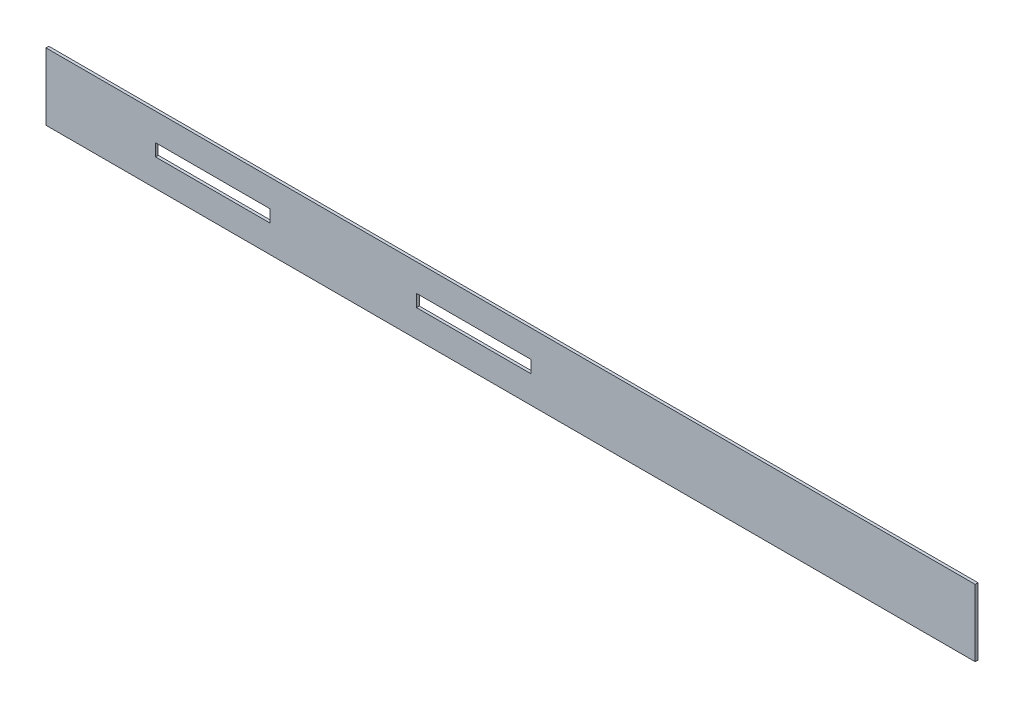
from build123d import *

# Parameters (mm, degrees)
ESQUISSE1_W             = 2633
ESQUISSE1_H             = 190
BOSS_EXTRU_1_DEPTH      = 8
ESQUISSE2_W             = 325
ESQUISSE2_H             = 35
ENL_V_MAT_EXTRU_1_DEPTH = 1474.736001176


with BuildPart() as part:
    # Esquisse1 → Boss.-Extru.1 (new body)
    with BuildSketch(Plane.XY):
        with Locations((-100.604626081, 309.534646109)):
            Rectangle(ESQUISSE1_W, ESQUISSE1_H)
    extrude(amount=BOSS_EXTRU_1_DEPTH)

    # Esquisse2 → Enl_v. mat.-Extru.1 (cut, through all)
    with BuildSketch(Plane.XY.offset(8)):
        with Locations((-944.604626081, 309.534646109)):
            Rectangle(ESQUISSE2_W, ESQUISSE2_H)
        with Locations((-204.604626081, 309.534646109)):
            Rectangle(ESQUISSE2_W, ESQUISSE2_H)
    extrude(amount=-ENL_V_MAT_EXTRU_1_DEPTH, mode=Mode.SUBTRACT)


solid = part.part
